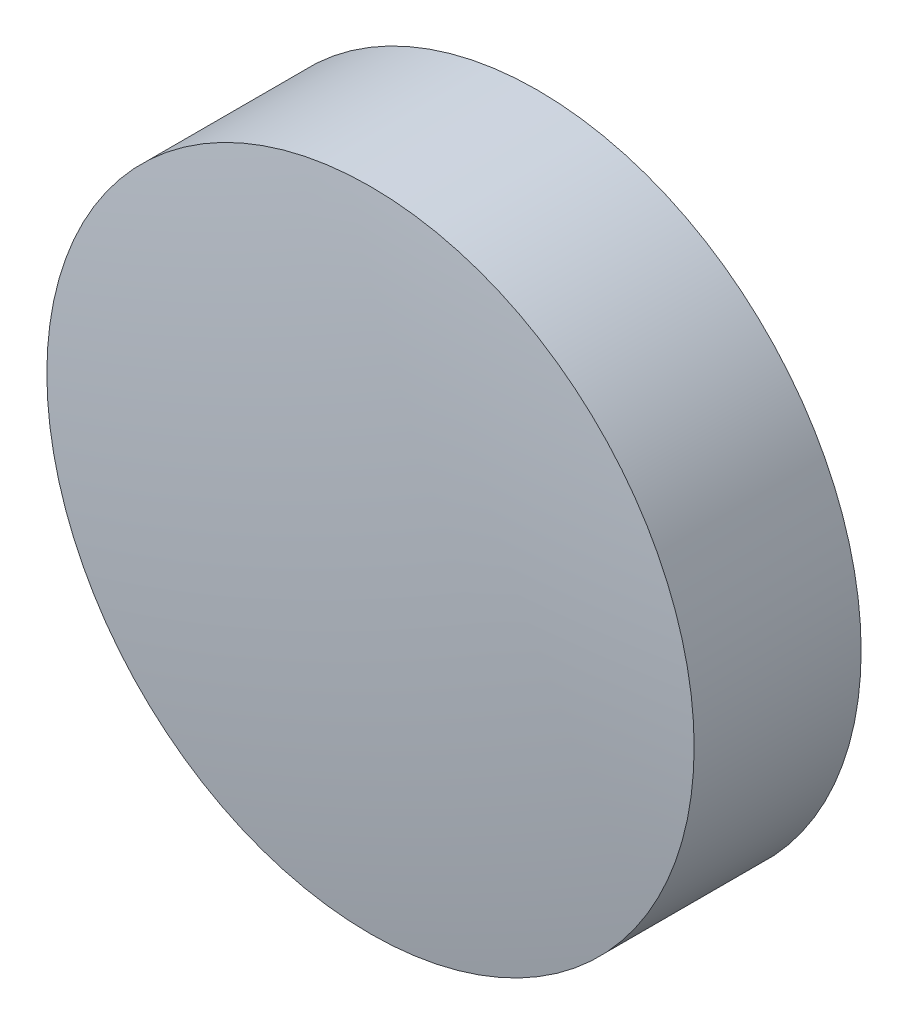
ISO-10303-21;
HEADER;
FILE_DESCRIPTION(('STEP AP214'),'2;1');
FILE_NAME('part.step','',(''),(''),'','','');
FILE_SCHEMA(('AUTOMOTIVE_DESIGN { 1 0 10303 214 1 1 1 1 }'));
ENDSEC;
DATA;
#1=APPLICATION_CONTEXT('core data for automotive mechanical design processes');
#2=APPLICATION_PROTOCOL_DEFINITION('international standard','automotive_design',2000,#1);
#3=PRODUCT_CONTEXT('',#1,'mechanical');
#4=PRODUCT('Part','Part','',(#3));
#5=PRODUCT_RELATED_PRODUCT_CATEGORY('part','',(#4));
#6=PRODUCT_DEFINITION_FORMATION('','',#4);
#7=PRODUCT_DEFINITION_CONTEXT('part definition',#1,'design');
#8=PRODUCT_DEFINITION('design','',#6,#7);
#9=PRODUCT_DEFINITION_SHAPE('','',#8);
#10=(LENGTH_UNIT() NAMED_UNIT(*) SI_UNIT(.MILLI.,.METRE.));
#11=(NAMED_UNIT(*) PLANE_ANGLE_UNIT() SI_UNIT($,.RADIAN.));
#12=(NAMED_UNIT(*) SI_UNIT($,.STERADIAN.) SOLID_ANGLE_UNIT());
#13=UNCERTAINTY_MEASURE_WITH_UNIT(LENGTH_MEASURE(1.E-05),#10,'distance_accuracy_value','');
#14=(GEOMETRIC_REPRESENTATION_CONTEXT(3) GLOBAL_UNCERTAINTY_ASSIGNED_CONTEXT((#13)) GLOBAL_UNIT_ASSIGNED_CONTEXT((#10,
#11,#12)) REPRESENTATION_CONTEXT('',''));
#15=CARTESIAN_POINT('',(0.,0.,0.));
#16=DIRECTION('',(0.,0.,1.));
#17=DIRECTION('',(1.,0.,0.));
#18=AXIS2_PLACEMENT_3D('',#15,#16,#17);
#19=CARTESIAN_POINT('',(0.,0.,269.291808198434));
#20=DIRECTION('',(0.,0.,1.));
#21=DIRECTION('',(1.,0.,0.));
#22=AXIS2_PLACEMENT_3D('',#19,#20,#21);
#23=CYLINDRICAL_SURFACE('',#22,25.);
#24=CARTESIAN_POINT('',(0.,0.,282.191208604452));
#25=DIRECTION('',(0.,0.,1.));
#26=DIRECTION('',(1.,0.,0.));
#27=AXIS2_PLACEMENT_3D('',#24,#25,#26);
#28=CIRCLE('',#27,25.);
#29=CARTESIAN_POINT('',(25.,0.,282.191208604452));
#30=VERTEX_POINT('',#29);
#31=EDGE_CURVE('E19',#30,#30,#28,.T.);
#32=ORIENTED_EDGE('',*,*,#31,.F.);
#33=EDGE_LOOP('',(#32));
#34=FACE_BOUND('',#33,.T.);
#35=CARTESIAN_POINT('',(0.,0.,269.291808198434));
#36=DIRECTION('',(0.,0.,1.));
#37=DIRECTION('',(1.,0.,0.));
#38=AXIS2_PLACEMENT_3D('',#35,#36,#37);
#39=CIRCLE('',#38,25.);
#40=CARTESIAN_POINT('',(25.,0.,269.291808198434));
#41=VERTEX_POINT('',#40);
#42=EDGE_CURVE('E10',#41,#41,#39,.T.);
#43=ORIENTED_EDGE('',*,*,#42,.T.);
#44=EDGE_LOOP('',(#43));
#45=FACE_BOUND('',#44,.T.);
#46=ADVANCED_FACE('F14',(#34,#45),#23,.T.);
#47=CARTESIAN_POINT('',(0.,0.,91.8873565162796));
#48=DIRECTION('',(0.,-1.,0.));
#49=DIRECTION('',(0.,0.,1.));
#50=AXIS2_PLACEMENT_3D('',#47,#48,#49);
#51=SPHERICAL_SURFACE('',#50,191.93893851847);
#52=ORIENTED_EDGE('',*,*,#31,.T.);
#53=EDGE_LOOP('',(#52));
#54=FACE_BOUND('',#53,.T.);
#55=ADVANCED_FACE('F29',(#54),#51,.T.);
#56=CARTESIAN_POINT('',(0.,0.,418.645337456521));
#57=DIRECTION('',(0.,-1.,0.));
#58=DIRECTION('',(0.,0.,-1.));
#59=AXIS2_PLACEMENT_3D('',#56,#57,#58);
#60=SPHERICAL_SURFACE('',#59,151.431425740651);
#61=ORIENTED_EDGE('',*,*,#42,.F.);
#62=EDGE_LOOP('',(#61));
#63=FACE_BOUND('',#62,.T.);
#64=ADVANCED_FACE('F16',(#63),#60,.T.);
#65=CLOSED_SHELL('',(#46,#55,#64));
#66=MANIFOLD_SOLID_BREP('B1',#65);
#67=ADVANCED_BREP_SHAPE_REPRESENTATION('',(#18,#66),#14);
#68=SHAPE_DEFINITION_REPRESENTATION(#9,#67);
ENDSEC;
END-ISO-10303-21;
